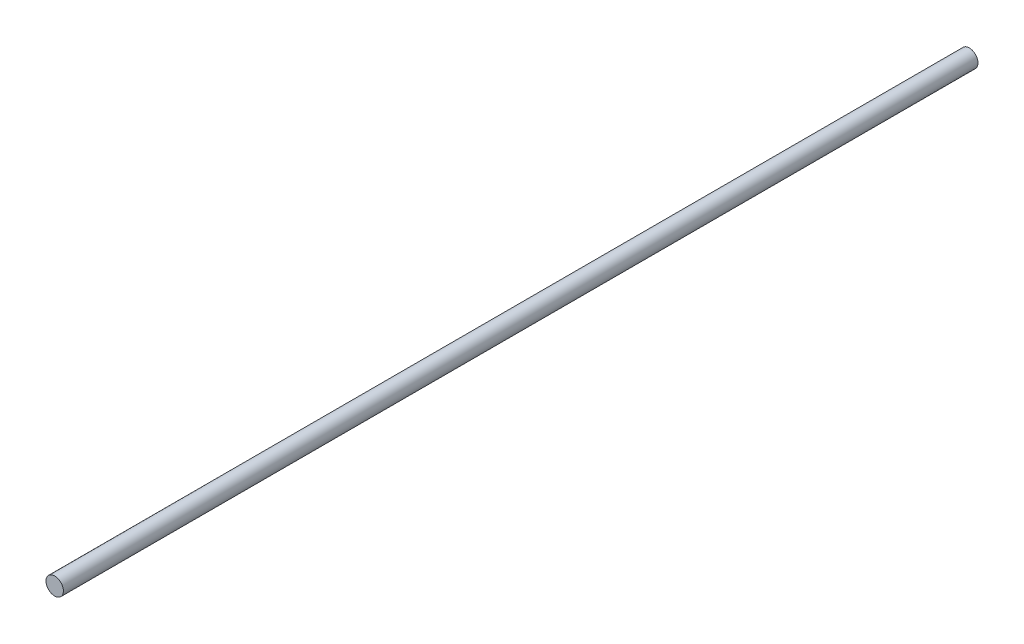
from build123d import *

# Parameters (mm, degrees)
SKETCH1_R           = 30
BOSS_EXTRUDE1_DEPTH = 3150


with BuildPart() as part:
    # Sketch1 → Boss-Extrude1 (new body)
    with BuildSketch(Plane.XY):
        Circle(SKETCH1_R)
    extrude(amount=-BOSS_EXTRUDE1_DEPTH)


solid = part.part
